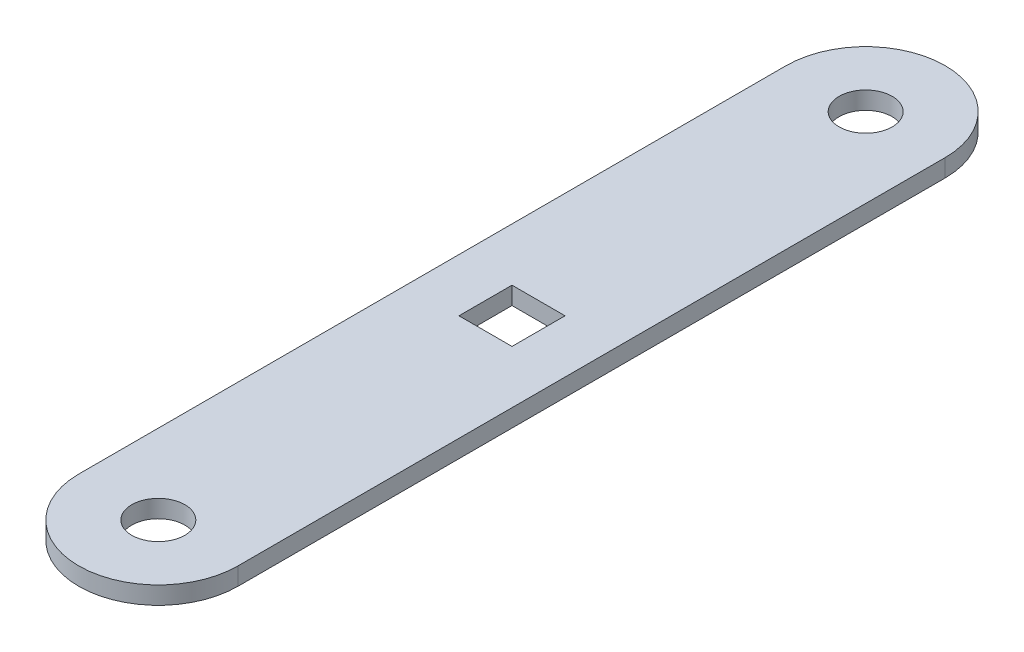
ISO-10303-21;
HEADER;
FILE_DESCRIPTION(('STEP AP214'),'2;1');
FILE_NAME('part.step','',(''),(''),'','','');
FILE_SCHEMA(('AUTOMOTIVE_DESIGN { 1 0 10303 214 1 1 1 1 }'));
ENDSEC;
DATA;
#1=APPLICATION_CONTEXT('core data for automotive mechanical design processes');
#2=APPLICATION_PROTOCOL_DEFINITION('international standard','automotive_design',2000,#1);
#3=PRODUCT_CONTEXT('',#1,'mechanical');
#4=PRODUCT('Part','Part','',(#3));
#5=PRODUCT_RELATED_PRODUCT_CATEGORY('part','',(#4));
#6=PRODUCT_DEFINITION_FORMATION('','',#4);
#7=PRODUCT_DEFINITION_CONTEXT('part definition',#1,'design');
#8=PRODUCT_DEFINITION('design','',#6,#7);
#9=PRODUCT_DEFINITION_SHAPE('','',#8);
#10=(LENGTH_UNIT() NAMED_UNIT(*) SI_UNIT(.MILLI.,.METRE.));
#11=(NAMED_UNIT(*) PLANE_ANGLE_UNIT() SI_UNIT($,.RADIAN.));
#12=(NAMED_UNIT(*) SI_UNIT($,.STERADIAN.) SOLID_ANGLE_UNIT());
#13=UNCERTAINTY_MEASURE_WITH_UNIT(LENGTH_MEASURE(1.E-05),#10,'distance_accuracy_value','');
#14=(GEOMETRIC_REPRESENTATION_CONTEXT(3) GLOBAL_UNCERTAINTY_ASSIGNED_CONTEXT((#13)) GLOBAL_UNIT_ASSIGNED_CONTEXT((#10,
#11,#12)) REPRESENTATION_CONTEXT('',''));
#15=CARTESIAN_POINT('',(0.,0.,0.));
#16=DIRECTION('',(0.,0.,1.));
#17=DIRECTION('',(1.,0.,0.));
#18=AXIS2_PLACEMENT_3D('',#15,#16,#17);
#19=CARTESIAN_POINT('',(-225.,50.,0.));
#20=DIRECTION('',(-1.,0.,0.));
#21=DIRECTION('',(0.,0.,1.));
#22=AXIS2_PLACEMENT_3D('',#19,#20,#21);
#23=PLANE('',#22);
#24=DIRECTION('',(0.,0.,-1.));
#25=VECTOR('',#24,1.);
#26=CARTESIAN_POINT('',(-225.,0.,0.));
#27=LINE('',#26,#25);
#28=CARTESIAN_POINT('',(-225.,0.,1000.));
#29=VERTEX_POINT('',#28);
#30=CARTESIAN_POINT('',(-225.,0.,-1000.));
#31=VERTEX_POINT('',#30);
#32=EDGE_CURVE('E173',#29,#31,#27,.T.);
#33=ORIENTED_EDGE('',*,*,#32,.F.);
#34=DIRECTION('',(0.,-1.,0.));
#35=VECTOR('',#34,1.);
#36=CARTESIAN_POINT('',(-225.,50.,1000.));
#37=LINE('',#36,#35);
#38=CARTESIAN_POINT('',(-225.,50.,1000.));
#39=VERTEX_POINT('',#38);
#40=EDGE_CURVE('E13',#39,#29,#37,.T.);
#41=ORIENTED_EDGE('',*,*,#40,.F.);
#42=DIRECTION('',(0.,0.,-1.));
#43=VECTOR('',#42,1.);
#44=CARTESIAN_POINT('',(-225.,50.,0.));
#45=LINE('',#44,#43);
#46=CARTESIAN_POINT('',(-225.,50.,-1000.));
#47=VERTEX_POINT('',#46);
#48=EDGE_CURVE('E161',#39,#47,#45,.T.);
#49=ORIENTED_EDGE('',*,*,#48,.T.);
#50=DIRECTION('',(0.,-1.,0.));
#51=VECTOR('',#50,1.);
#52=CARTESIAN_POINT('',(-225.,50.,-1000.));
#53=LINE('',#52,#51);
#54=EDGE_CURVE('E172',#47,#31,#53,.T.);
#55=ORIENTED_EDGE('',*,*,#54,.T.);
#56=EDGE_LOOP('',(#33,#41,#49,#55));
#57=FACE_BOUND('',#56,.T.);
#58=ADVANCED_FACE('F52',(#57),#23,.T.);
#59=CARTESIAN_POINT('',(0.,50.,1000.));
#60=DIRECTION('',(0.,-1.,0.));
#61=DIRECTION('',(0.,0.,-1.));
#62=AXIS2_PLACEMENT_3D('',#59,#60,#61);
#63=CYLINDRICAL_SURFACE('',#62,225.);
#64=CARTESIAN_POINT('',(0.,0.,1000.));
#65=DIRECTION('',(0.,1.,0.));
#66=DIRECTION('',(0.,0.,1.));
#67=AXIS2_PLACEMENT_3D('',#64,#65,#66);
#68=CIRCLE('',#67,225.);
#69=CARTESIAN_POINT('',(225.,0.,1000.));
#70=VERTEX_POINT('',#69);
#71=EDGE_CURVE('E176',#70,#29,#68,.F.);
#72=ORIENTED_EDGE('',*,*,#71,.F.);
#73=DIRECTION('',(0.,-1.,0.));
#74=VECTOR('',#73,1.);
#75=CARTESIAN_POINT('',(225.,50.,1000.));
#76=LINE('',#75,#74);
#77=CARTESIAN_POINT('',(225.,50.,1000.));
#78=VERTEX_POINT('',#77);
#79=EDGE_CURVE('E60',#78,#70,#76,.T.);
#80=ORIENTED_EDGE('',*,*,#79,.F.);
#81=CARTESIAN_POINT('',(0.,50.,1000.));
#82=DIRECTION('',(0.,1.,0.));
#83=DIRECTION('',(0.,0.,1.));
#84=AXIS2_PLACEMENT_3D('',#81,#82,#83);
#85=CIRCLE('',#84,225.);
#86=EDGE_CURVE('E164',#78,#39,#85,.F.);
#87=ORIENTED_EDGE('',*,*,#86,.T.);
#88=ORIENTED_EDGE('',*,*,#40,.T.);
#89=EDGE_LOOP('',(#72,#80,#87,#88));
#90=FACE_BOUND('',#89,.T.);
#91=ADVANCED_FACE('F197',(#90),#63,.T.);
#92=CARTESIAN_POINT('',(225.,50.,0.));
#93=DIRECTION('',(-1.,0.,0.));
#94=DIRECTION('',(0.,0.,1.));
#95=AXIS2_PLACEMENT_3D('',#92,#93,#94);
#96=PLANE('',#95);
#97=DIRECTION('',(0.,0.,-1.));
#98=VECTOR('',#97,1.);
#99=CARTESIAN_POINT('',(225.,0.,0.));
#100=LINE('',#99,#98);
#101=CARTESIAN_POINT('',(225.,0.,-1000.));
#102=VERTEX_POINT('',#101);
#103=EDGE_CURVE('E179',#70,#102,#100,.T.);
#104=ORIENTED_EDGE('',*,*,#103,.T.);
#105=DIRECTION('',(0.,-1.,0.));
#106=VECTOR('',#105,1.);
#107=CARTESIAN_POINT('',(225.,50.,-1000.));
#108=LINE('',#107,#106);
#109=CARTESIAN_POINT('',(225.,50.,-1000.));
#110=VERTEX_POINT('',#109);
#111=EDGE_CURVE('E184',#110,#102,#108,.T.);
#112=ORIENTED_EDGE('',*,*,#111,.F.);
#113=DIRECTION('',(0.,0.,-1.));
#114=VECTOR('',#113,1.);
#115=CARTESIAN_POINT('',(225.,50.,0.));
#116=LINE('',#115,#114);
#117=EDGE_CURVE('E168',#78,#110,#116,.T.);
#118=ORIENTED_EDGE('',*,*,#117,.F.);
#119=ORIENTED_EDGE('',*,*,#79,.T.);
#120=EDGE_LOOP('',(#104,#112,#118,#119));
#121=FACE_BOUND('',#120,.T.);
#122=ADVANCED_FACE('F190',(#121),#96,.F.);
#123=CARTESIAN_POINT('',(0.,50.,-1000.));
#124=DIRECTION('',(0.,-1.,0.));
#125=DIRECTION('',(0.,0.,-1.));
#126=AXIS2_PLACEMENT_3D('',#123,#124,#125);
#127=CYLINDRICAL_SURFACE('',#126,225.);
#128=CARTESIAN_POINT('',(0.,0.,-1000.));
#129=DIRECTION('',(0.,1.,0.));
#130=DIRECTION('',(0.,0.,1.));
#131=AXIS2_PLACEMENT_3D('',#128,#129,#130);
#132=CIRCLE('',#131,225.);
#133=EDGE_CURVE('E165',#102,#31,#132,.T.);
#134=ORIENTED_EDGE('',*,*,#133,.T.);
#135=ORIENTED_EDGE('',*,*,#54,.F.);
#136=CARTESIAN_POINT('',(0.,50.,-1000.));
#137=DIRECTION('',(0.,1.,0.));
#138=DIRECTION('',(0.,0.,1.));
#139=AXIS2_PLACEMENT_3D('',#136,#137,#138);
#140=CIRCLE('',#139,225.);
#141=EDGE_CURVE('E170',#110,#47,#140,.T.);
#142=ORIENTED_EDGE('',*,*,#141,.F.);
#143=ORIENTED_EDGE('',*,*,#111,.T.);
#144=EDGE_LOOP('',(#134,#135,#142,#143));
#145=FACE_BOUND('',#144,.T.);
#146=ADVANCED_FACE('F204',(#145),#127,.T.);
#147=CARTESIAN_POINT('',(0.,50.,0.));
#148=DIRECTION('',(0.,1.,0.));
#149=DIRECTION('',(0.,0.,1.));
#150=AXIS2_PLACEMENT_3D('',#147,#148,#149);
#151=PLANE('',#150);
#152=DIRECTION('',(0.,0.,-1.));
#153=VECTOR('',#152,1.);
#154=CARTESIAN_POINT('',(75.,50.,75.));
#155=LINE('',#154,#153);
#156=CARTESIAN_POINT('',(75.,50.,75.));
#157=VERTEX_POINT('',#156);
#158=CARTESIAN_POINT('',(75.,50.,-75.));
#159=VERTEX_POINT('',#158);
#160=EDGE_CURVE('E67',#157,#159,#155,.T.);
#161=ORIENTED_EDGE('',*,*,#160,.F.);
#162=DIRECTION('',(1.,0.,0.));
#163=VECTOR('',#162,1.);
#164=CARTESIAN_POINT('',(-75.,50.,75.));
#165=LINE('',#164,#163);
#166=CARTESIAN_POINT('',(-75.,50.,75.));
#167=VERTEX_POINT('',#166);
#168=EDGE_CURVE('E134',#167,#157,#165,.T.);
#169=ORIENTED_EDGE('',*,*,#168,.F.);
#170=DIRECTION('',(0.,0.,1.));
#171=VECTOR('',#170,1.);
#172=CARTESIAN_POINT('',(-75.,50.,75.));
#173=LINE('',#172,#171);
#174=CARTESIAN_POINT('',(-75.,50.,-75.));
#175=VERTEX_POINT('',#174);
#176=EDGE_CURVE('E137',#175,#167,#173,.T.);
#177=ORIENTED_EDGE('',*,*,#176,.F.);
#178=DIRECTION('',(-1.,0.,0.));
#179=VECTOR('',#178,1.);
#180=CARTESIAN_POINT('',(-75.,50.,-75.));
#181=LINE('',#180,#179);
#182=EDGE_CURVE('E143',#159,#175,#181,.T.);
#183=ORIENTED_EDGE('',*,*,#182,.F.);
#184=EDGE_LOOP('',(#161,#169,#177,#183));
#185=FACE_BOUND('',#184,.T.);
#186=CARTESIAN_POINT('',(0.,50.,1000.));
#187=DIRECTION('',(0.,1.,0.));
#188=DIRECTION('',(0.,0.,1.));
#189=AXIS2_PLACEMENT_3D('',#186,#187,#188);
#190=CIRCLE('',#189,75.);
#191=CARTESIAN_POINT('',(0.,50.,1075.));
#192=VERTEX_POINT('',#191);
#193=EDGE_CURVE('E149',#192,#192,#190,.T.);
#194=ORIENTED_EDGE('',*,*,#193,.F.);
#195=EDGE_LOOP('',(#194));
#196=FACE_BOUND('',#195,.T.);
#197=CARTESIAN_POINT('',(0.,50.,-1000.));
#198=DIRECTION('',(0.,1.,0.));
#199=DIRECTION('',(0.,0.,1.));
#200=AXIS2_PLACEMENT_3D('',#197,#198,#199);
#201=CIRCLE('',#200,75.);
#202=CARTESIAN_POINT('',(0.,50.,-925.));
#203=VERTEX_POINT('',#202);
#204=EDGE_CURVE('E156',#203,#203,#201,.T.);
#205=ORIENTED_EDGE('',*,*,#204,.F.);
#206=EDGE_LOOP('',(#205));
#207=FACE_BOUND('',#206,.T.);
#208=ORIENTED_EDGE('',*,*,#48,.F.);
#209=ORIENTED_EDGE('',*,*,#86,.F.);
#210=ORIENTED_EDGE('',*,*,#117,.T.);
#211=ORIENTED_EDGE('',*,*,#141,.T.);
#212=EDGE_LOOP('',(#208,#209,#210,#211));
#213=FACE_BOUND('',#212,.T.);
#214=ADVANCED_FACE('F206',(#185,#196,#207,#213),#151,.T.);
#215=CARTESIAN_POINT('',(0.,0.,0.));
#216=DIRECTION('',(0.,1.,0.));
#217=DIRECTION('',(0.,0.,1.));
#218=AXIS2_PLACEMENT_3D('',#215,#216,#217);
#219=PLANE('',#218);
#220=DIRECTION('',(1.,0.,0.));
#221=VECTOR('',#220,1.);
#222=CARTESIAN_POINT('',(-75.,0.,75.));
#223=LINE('',#222,#221);
#224=CARTESIAN_POINT('',(-75.,0.,75.));
#225=VERTEX_POINT('',#224);
#226=CARTESIAN_POINT('',(75.,0.,75.));
#227=VERTEX_POINT('',#226);
#228=EDGE_CURVE('E124',#225,#227,#223,.T.);
#229=ORIENTED_EDGE('',*,*,#228,.T.);
#230=DIRECTION('',(0.,0.,-1.));
#231=VECTOR('',#230,1.);
#232=CARTESIAN_POINT('',(75.,0.,75.));
#233=LINE('',#232,#231);
#234=CARTESIAN_POINT('',(75.,0.,-75.));
#235=VERTEX_POINT('',#234);
#236=EDGE_CURVE('E118',#227,#235,#233,.T.);
#237=ORIENTED_EDGE('',*,*,#236,.T.);
#238=DIRECTION('',(-1.,0.,0.));
#239=VECTOR('',#238,1.);
#240=CARTESIAN_POINT('',(-75.,0.,-75.));
#241=LINE('',#240,#239);
#242=CARTESIAN_POINT('',(-75.,0.,-75.));
#243=VERTEX_POINT('',#242);
#244=EDGE_CURVE('E127',#235,#243,#241,.T.);
#245=ORIENTED_EDGE('',*,*,#244,.T.);
#246=DIRECTION('',(0.,0.,1.));
#247=VECTOR('',#246,1.);
#248=CARTESIAN_POINT('',(-75.,0.,75.));
#249=LINE('',#248,#247);
#250=EDGE_CURVE('E75',#243,#225,#249,.T.);
#251=ORIENTED_EDGE('',*,*,#250,.T.);
#252=EDGE_LOOP('',(#229,#237,#245,#251));
#253=FACE_BOUND('',#252,.T.);
#254=CARTESIAN_POINT('',(0.,0.,1000.));
#255=DIRECTION('',(0.,1.,0.));
#256=DIRECTION('',(0.,0.,1.));
#257=AXIS2_PLACEMENT_3D('',#254,#255,#256);
#258=CIRCLE('',#257,75.);
#259=CARTESIAN_POINT('',(0.,0.,1075.));
#260=VERTEX_POINT('',#259);
#261=EDGE_CURVE('E153',#260,#260,#258,.T.);
#262=ORIENTED_EDGE('',*,*,#261,.T.);
#263=EDGE_LOOP('',(#262));
#264=FACE_BOUND('',#263,.T.);
#265=CARTESIAN_POINT('',(0.,0.,-1000.));
#266=DIRECTION('',(0.,1.,0.));
#267=DIRECTION('',(0.,0.,1.));
#268=AXIS2_PLACEMENT_3D('',#265,#266,#267);
#269=CIRCLE('',#268,75.);
#270=CARTESIAN_POINT('',(0.,0.,-925.));
#271=VERTEX_POINT('',#270);
#272=EDGE_CURVE('E55',#271,#271,#269,.T.);
#273=ORIENTED_EDGE('',*,*,#272,.T.);
#274=EDGE_LOOP('',(#273));
#275=FACE_BOUND('',#274,.T.);
#276=ORIENTED_EDGE('',*,*,#32,.T.);
#277=ORIENTED_EDGE('',*,*,#133,.F.);
#278=ORIENTED_EDGE('',*,*,#103,.F.);
#279=ORIENTED_EDGE('',*,*,#71,.T.);
#280=EDGE_LOOP('',(#276,#277,#278,#279));
#281=FACE_BOUND('',#280,.T.);
#282=ADVANCED_FACE('F131',(#253,#264,#275,#281),#219,.F.);
#283=CARTESIAN_POINT('',(0.,-200.,-1000.));
#284=DIRECTION('',(0.,1.,0.));
#285=DIRECTION('',(0.,0.,1.));
#286=AXIS2_PLACEMENT_3D('',#283,#284,#285);
#287=CYLINDRICAL_SURFACE('',#286,75.);
#288=ORIENTED_EDGE('',*,*,#204,.T.);
#289=EDGE_LOOP('',(#288));
#290=FACE_BOUND('',#289,.T.);
#291=ORIENTED_EDGE('',*,*,#272,.F.);
#292=EDGE_LOOP('',(#291));
#293=FACE_BOUND('',#292,.T.);
#294=ADVANCED_FACE('F214',(#290,#293),#287,.F.);
#295=CARTESIAN_POINT('',(0.,0.,1000.));
#296=DIRECTION('',(0.,1.,0.));
#297=DIRECTION('',(0.,0.,1.));
#298=AXIS2_PLACEMENT_3D('',#295,#296,#297);
#299=CYLINDRICAL_SURFACE('',#298,75.);
#300=ORIENTED_EDGE('',*,*,#261,.F.);
#301=EDGE_LOOP('',(#300));
#302=FACE_BOUND('',#301,.T.);
#303=ORIENTED_EDGE('',*,*,#193,.T.);
#304=EDGE_LOOP('',(#303));
#305=FACE_BOUND('',#304,.T.);
#306=ADVANCED_FACE('F255',(#302,#305),#299,.F.);
#307=CARTESIAN_POINT('',(75.,0.,75.));
#308=DIRECTION('',(1.,0.,0.));
#309=DIRECTION('',(0.,0.,-1.));
#310=AXIS2_PLACEMENT_3D('',#307,#308,#309);
#311=PLANE('',#310);
#312=ORIENTED_EDGE('',*,*,#160,.T.);
#313=DIRECTION('',(0.,1.,0.));
#314=VECTOR('',#313,1.);
#315=CARTESIAN_POINT('',(75.,0.,-75.));
#316=LINE('',#315,#314);
#317=EDGE_CURVE('E114',#235,#159,#316,.T.);
#318=ORIENTED_EDGE('',*,*,#317,.F.);
#319=ORIENTED_EDGE('',*,*,#236,.F.);
#320=DIRECTION('',(0.,1.,0.));
#321=VECTOR('',#320,1.);
#322=CARTESIAN_POINT('',(75.,0.,75.));
#323=LINE('',#322,#321);
#324=EDGE_CURVE('E147',#227,#157,#323,.T.);
#325=ORIENTED_EDGE('',*,*,#324,.T.);
#326=EDGE_LOOP('',(#312,#318,#319,#325));
#327=FACE_BOUND('',#326,.T.);
#328=ADVANCED_FACE('F116',(#327),#311,.F.);
#329=CARTESIAN_POINT('',(-75.,0.,75.));
#330=DIRECTION('',(0.,0.,1.));
#331=DIRECTION('',(1.,0.,0.));
#332=AXIS2_PLACEMENT_3D('',#329,#330,#331);
#333=PLANE('',#332);
#334=ORIENTED_EDGE('',*,*,#168,.T.);
#335=ORIENTED_EDGE('',*,*,#324,.F.);
#336=ORIENTED_EDGE('',*,*,#228,.F.);
#337=DIRECTION('',(0.,1.,0.));
#338=VECTOR('',#337,1.);
#339=CARTESIAN_POINT('',(-75.,0.,75.));
#340=LINE('',#339,#338);
#341=EDGE_CURVE('E150',#225,#167,#340,.T.);
#342=ORIENTED_EDGE('',*,*,#341,.T.);
#343=EDGE_LOOP('',(#334,#335,#336,#342));
#344=FACE_BOUND('',#343,.T.);
#345=ADVANCED_FACE('F266',(#344),#333,.F.);
#346=CARTESIAN_POINT('',(-75.,0.,75.));
#347=DIRECTION('',(-1.,0.,0.));
#348=DIRECTION('',(0.,0.,1.));
#349=AXIS2_PLACEMENT_3D('',#346,#347,#348);
#350=PLANE('',#349);
#351=ORIENTED_EDGE('',*,*,#176,.T.);
#352=ORIENTED_EDGE('',*,*,#341,.F.);
#353=ORIENTED_EDGE('',*,*,#250,.F.);
#354=DIRECTION('',(0.,1.,0.));
#355=VECTOR('',#354,1.);
#356=CARTESIAN_POINT('',(-75.,0.,-75.));
#357=LINE('',#356,#355);
#358=EDGE_CURVE('E123',#243,#175,#357,.T.);
#359=ORIENTED_EDGE('',*,*,#358,.T.);
#360=EDGE_LOOP('',(#351,#352,#353,#359));
#361=FACE_BOUND('',#360,.T.);
#362=ADVANCED_FACE('F273',(#361),#350,.F.);
#363=CARTESIAN_POINT('',(-75.,0.,-75.));
#364=DIRECTION('',(0.,0.,-1.));
#365=DIRECTION('',(-1.,0.,0.));
#366=AXIS2_PLACEMENT_3D('',#363,#364,#365);
#367=PLANE('',#366);
#368=ORIENTED_EDGE('',*,*,#182,.T.);
#369=ORIENTED_EDGE('',*,*,#358,.F.);
#370=ORIENTED_EDGE('',*,*,#244,.F.);
#371=ORIENTED_EDGE('',*,*,#317,.T.);
#372=EDGE_LOOP('',(#368,#369,#370,#371));
#373=FACE_BOUND('',#372,.T.);
#374=ADVANCED_FACE('F128',(#373),#367,.F.);
#375=CLOSED_SHELL('',(#58,#91,#122,#146,#214,#282,#294,#306,#328,#345,#362,#374));
#376=MANIFOLD_SOLID_BREP('B2',#375);
#377=ADVANCED_BREP_SHAPE_REPRESENTATION('',(#18,#376),#14);
#378=SHAPE_DEFINITION_REPRESENTATION(#9,#377);
ENDSEC;
END-ISO-10303-21;
